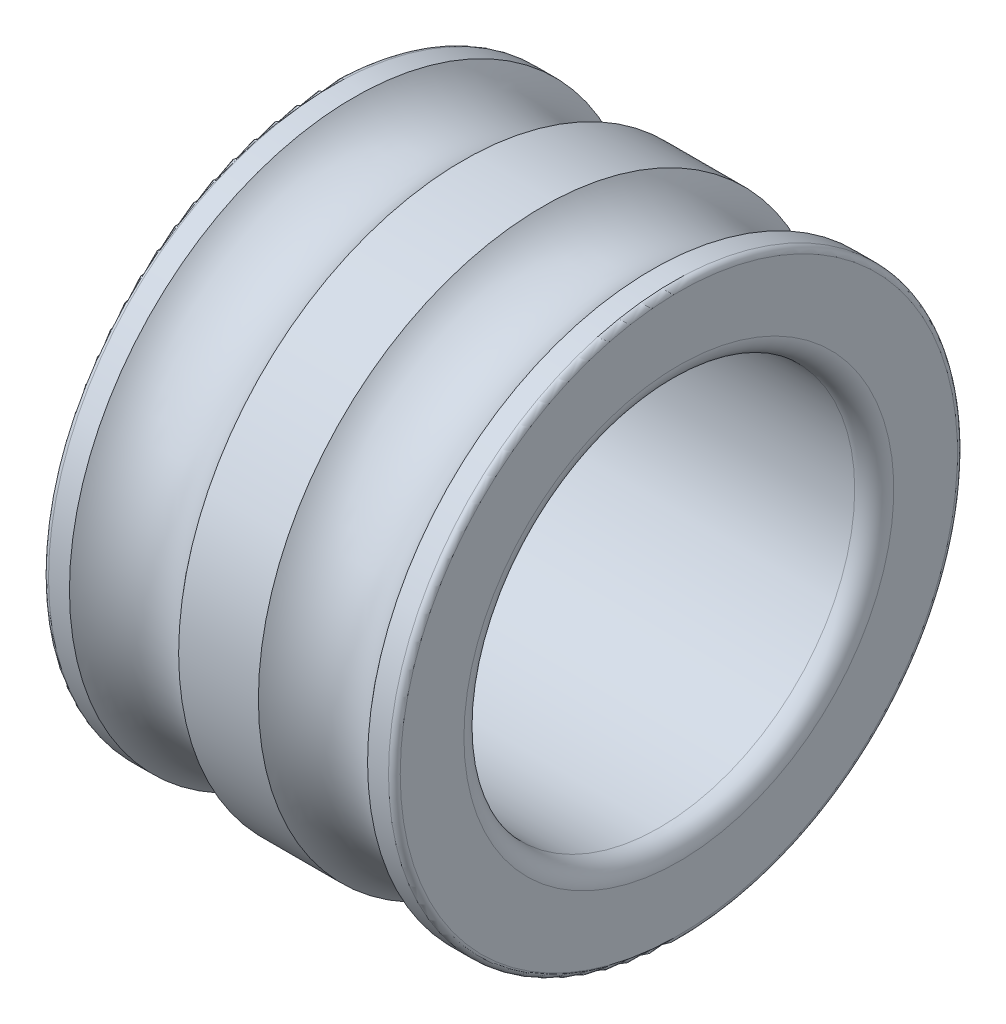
ISO-10303-21;
HEADER;
FILE_DESCRIPTION(('STEP AP214'),'2;1');
FILE_NAME('part.step','',(''),(''),'','','');
FILE_SCHEMA(('AUTOMOTIVE_DESIGN { 1 0 10303 214 1 1 1 1 }'));
ENDSEC;
DATA;
#1=APPLICATION_CONTEXT('core data for automotive mechanical design processes');
#2=APPLICATION_PROTOCOL_DEFINITION('international standard','automotive_design',2000,#1);
#3=PRODUCT_CONTEXT('',#1,'mechanical');
#4=PRODUCT('Part','Part','',(#3));
#5=PRODUCT_RELATED_PRODUCT_CATEGORY('part','',(#4));
#6=PRODUCT_DEFINITION_FORMATION('','',#4);
#7=PRODUCT_DEFINITION_CONTEXT('part definition',#1,'design');
#8=PRODUCT_DEFINITION('design','',#6,#7);
#9=PRODUCT_DEFINITION_SHAPE('','',#8);
#10=(LENGTH_UNIT() NAMED_UNIT(*) SI_UNIT(.MILLI.,.METRE.));
#11=(NAMED_UNIT(*) PLANE_ANGLE_UNIT() SI_UNIT($,.RADIAN.));
#12=(NAMED_UNIT(*) SI_UNIT($,.STERADIAN.) SOLID_ANGLE_UNIT());
#13=UNCERTAINTY_MEASURE_WITH_UNIT(LENGTH_MEASURE(1.E-05),#10,'distance_accuracy_value','');
#14=(GEOMETRIC_REPRESENTATION_CONTEXT(3) GLOBAL_UNCERTAINTY_ASSIGNED_CONTEXT((#13)) GLOBAL_UNIT_ASSIGNED_CONTEXT((#10,
#11,#12)) REPRESENTATION_CONTEXT('',''));
#15=CARTESIAN_POINT('',(0.,0.,0.));
#16=DIRECTION('',(0.,0.,1.));
#17=DIRECTION('',(1.,0.,0.));
#18=AXIS2_PLACEMENT_3D('',#15,#16,#17);
#19=CARTESIAN_POINT('',(0.,0.,0.));
#20=DIRECTION('',(-1.,0.,0.));
#21=DIRECTION('',(0.,0.,1.));
#22=AXIS2_PLACEMENT_3D('',#19,#20,#21);
#23=CYLINDRICAL_SURFACE('',#22,14.56);
#24=CARTESIAN_POINT('',(11.0406455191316,0.,0.));
#25=DIRECTION('',(-1.,0.,0.));
#26=DIRECTION('',(0.,0.,1.));
#27=AXIS2_PLACEMENT_3D('',#24,#25,#26);
#28=CIRCLE('',#27,14.56);
#29=CARTESIAN_POINT('',(11.0406455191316,0.,14.56));
#30=VERTEX_POINT('',#29);
#31=EDGE_CURVE('E10',#30,#30,#28,.T.);
#32=ORIENTED_EDGE('',*,*,#31,.T.);
#33=EDGE_LOOP('',(#32));
#34=FACE_BOUND('',#33,.T.);
#35=CARTESIAN_POINT('',(6.95935448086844,0.,0.));
#36=DIRECTION('',(-1.,0.,0.));
#37=DIRECTION('',(0.,0.,1.));
#38=AXIS2_PLACEMENT_3D('',#35,#36,#37);
#39=CIRCLE('',#38,14.56);
#40=CARTESIAN_POINT('',(6.95935448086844,0.,14.56));
#41=VERTEX_POINT('',#40);
#42=EDGE_CURVE('E55',#41,#41,#39,.T.);
#43=ORIENTED_EDGE('',*,*,#42,.F.);
#44=EDGE_LOOP('',(#43));
#45=FACE_BOUND('',#44,.T.);
#46=ADVANCED_FACE('F15',(#34,#45),#23,.T.);
#47=CARTESIAN_POINT('',(13.8346390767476,0.,0.));
#48=DIRECTION('',(-1.,0.,0.));
#49=DIRECTION('',(0.,0.,1.));
#50=AXIS2_PLACEMENT_3D('',#47,#48,#49);
#51=TOROIDAL_SURFACE('',#50,16.75,3.55);
#52=CARTESIAN_POINT('',(16.6286326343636,0.,0.));
#53=DIRECTION('',(-1.,0.,0.));
#54=DIRECTION('',(0.,0.,1.));
#55=AXIS2_PLACEMENT_3D('',#52,#53,#54);
#56=CIRCLE('',#55,14.56);
#57=CARTESIAN_POINT('',(16.6286326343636,0.,14.56));
#58=VERTEX_POINT('',#57);
#59=EDGE_CURVE('E21',#58,#58,#56,.T.);
#60=ORIENTED_EDGE('',*,*,#59,.T.);
#61=EDGE_LOOP('',(#60));
#62=FACE_BOUND('',#61,.T.);
#63=ORIENTED_EDGE('',*,*,#31,.F.);
#64=EDGE_LOOP('',(#63));
#65=FACE_BOUND('',#64,.T.);
#66=ADVANCED_FACE('F63',(#62,#65),#51,.F.);
#67=CARTESIAN_POINT('',(0.,0.,0.));
#68=DIRECTION('',(-1.,0.,0.));
#69=DIRECTION('',(0.,0.,1.));
#70=AXIS2_PLACEMENT_3D('',#67,#68,#69);
#71=CYLINDRICAL_SURFACE('',#70,14.56);
#72=CARTESIAN_POINT('',(17.7,0.,0.));
#73=DIRECTION('',(-1.,0.,0.));
#74=DIRECTION('',(0.,0.,1.));
#75=AXIS2_PLACEMENT_3D('',#72,#73,#74);
#76=CIRCLE('',#75,14.56);
#77=CARTESIAN_POINT('',(17.7,0.,14.56));
#78=VERTEX_POINT('',#77);
#79=EDGE_CURVE('E25',#78,#78,#76,.T.);
#80=ORIENTED_EDGE('',*,*,#79,.T.);
#81=EDGE_LOOP('',(#80));
#82=FACE_BOUND('',#81,.T.);
#83=ORIENTED_EDGE('',*,*,#59,.F.);
#84=EDGE_LOOP('',(#83));
#85=FACE_BOUND('',#84,.T.);
#86=ADVANCED_FACE('F69',(#82,#85),#71,.T.);
#87=CARTESIAN_POINT('',(17.7,0.,0.));
#88=DIRECTION('',(-1.,0.,0.));
#89=DIRECTION('',(0.,0.,1.));
#90=AXIS2_PLACEMENT_3D('',#87,#88,#89);
#91=TOROIDAL_SURFACE('',#90,14.26,0.3);
#92=ORIENTED_EDGE('',*,*,#79,.F.);
#93=EDGE_LOOP('',(#92));
#94=FACE_BOUND('',#93,.T.);
#95=CARTESIAN_POINT('',(18.,0.,0.));
#96=DIRECTION('',(-1.,0.,0.));
#97=DIRECTION('',(0.,0.,1.));
#98=AXIS2_PLACEMENT_3D('',#95,#96,#97);
#99=CIRCLE('',#98,14.26);
#100=CARTESIAN_POINT('',(18.,0.,14.26));
#101=VERTEX_POINT('',#100);
#102=EDGE_CURVE('E29',#101,#101,#99,.T.);
#103=ORIENTED_EDGE('',*,*,#102,.T.);
#104=EDGE_LOOP('',(#103));
#105=FACE_BOUND('',#104,.T.);
#106=ADVANCED_FACE('F74',(#94,#105),#91,.T.);
#107=CARTESIAN_POINT('',(18.,11.,0.));
#108=DIRECTION('',(-1.,0.,0.));
#109=DIRECTION('',(0.,0.,1.));
#110=AXIS2_PLACEMENT_3D('',#107,#108,#109);
#111=PLANE('',#110);
#112=ORIENTED_EDGE('',*,*,#102,.F.);
#113=EDGE_LOOP('',(#112));
#114=FACE_BOUND('',#113,.T.);
#115=CARTESIAN_POINT('',(18.,0.,0.));
#116=DIRECTION('',(-1.,0.,0.));
#117=DIRECTION('',(0.,0.,1.));
#118=AXIS2_PLACEMENT_3D('',#115,#116,#117);
#119=CIRCLE('',#118,11.);
#120=CARTESIAN_POINT('',(18.,0.,11.));
#121=VERTEX_POINT('',#120);
#122=EDGE_CURVE('E34',#121,#121,#119,.T.);
#123=ORIENTED_EDGE('',*,*,#122,.T.);
#124=EDGE_LOOP('',(#123));
#125=FACE_BOUND('',#124,.T.);
#126=ADVANCED_FACE('F81',(#114,#125),#111,.F.);
#127=CARTESIAN_POINT('',(17.,0.,0.));
#128=DIRECTION('',(-1.,0.,0.));
#129=DIRECTION('',(0.,0.,1.));
#130=AXIS2_PLACEMENT_3D('',#127,#128,#129);
#131=TOROIDAL_SURFACE('',#130,11.,1.);
#132=ORIENTED_EDGE('',*,*,#122,.F.);
#133=EDGE_LOOP('',(#132));
#134=FACE_BOUND('',#133,.T.);
#135=CARTESIAN_POINT('',(17.,0.,0.));
#136=DIRECTION('',(-1.,0.,0.));
#137=DIRECTION('',(0.,0.,1.));
#138=AXIS2_PLACEMENT_3D('',#135,#136,#137);
#139=CIRCLE('',#138,10.);
#140=CARTESIAN_POINT('',(17.,0.,10.));
#141=VERTEX_POINT('',#140);
#142=EDGE_CURVE('E37',#141,#141,#139,.T.);
#143=ORIENTED_EDGE('',*,*,#142,.T.);
#144=EDGE_LOOP('',(#143));
#145=FACE_BOUND('',#144,.T.);
#146=ADVANCED_FACE('F85',(#134,#145),#131,.T.);
#147=CARTESIAN_POINT('',(0.,0.,0.));
#148=DIRECTION('',(-1.,0.,0.));
#149=DIRECTION('',(0.,0.,1.));
#150=AXIS2_PLACEMENT_3D('',#147,#148,#149);
#151=CYLINDRICAL_SURFACE('',#150,10.);
#152=ORIENTED_EDGE('',*,*,#142,.F.);
#153=EDGE_LOOP('',(#152));
#154=FACE_BOUND('',#153,.T.);
#155=CARTESIAN_POINT('',(1.,0.,0.));
#156=DIRECTION('',(-1.,0.,0.));
#157=DIRECTION('',(0.,0.,1.));
#158=AXIS2_PLACEMENT_3D('',#155,#156,#157);
#159=CIRCLE('',#158,10.);
#160=CARTESIAN_POINT('',(1.,0.,10.));
#161=VERTEX_POINT('',#160);
#162=EDGE_CURVE('E40',#161,#161,#159,.T.);
#163=ORIENTED_EDGE('',*,*,#162,.T.);
#164=EDGE_LOOP('',(#163));
#165=FACE_BOUND('',#164,.T.);
#166=ADVANCED_FACE('F89',(#154,#165),#151,.F.);
#167=CARTESIAN_POINT('',(1.,0.,0.));
#168=DIRECTION('',(-1.,0.,0.));
#169=DIRECTION('',(0.,0.,1.));
#170=AXIS2_PLACEMENT_3D('',#167,#168,#169);
#171=TOROIDAL_SURFACE('',#170,11.,1.);
#172=ORIENTED_EDGE('',*,*,#162,.F.);
#173=EDGE_LOOP('',(#172));
#174=FACE_BOUND('',#173,.T.);
#175=CARTESIAN_POINT('',(0.,0.,0.));
#176=DIRECTION('',(-1.,0.,0.));
#177=DIRECTION('',(0.,0.,1.));
#178=AXIS2_PLACEMENT_3D('',#175,#176,#177);
#179=CIRCLE('',#178,11.);
#180=CARTESIAN_POINT('',(0.,0.,11.));
#181=VERTEX_POINT('',#180);
#182=EDGE_CURVE('E43',#181,#181,#179,.T.);
#183=ORIENTED_EDGE('',*,*,#182,.T.);
#184=EDGE_LOOP('',(#183));
#185=FACE_BOUND('',#184,.T.);
#186=ADVANCED_FACE('F93',(#174,#185),#171,.T.);
#187=CARTESIAN_POINT('',(0.,14.26,0.));
#188=DIRECTION('',(1.,0.,0.));
#189=DIRECTION('',(0.,0.,-1.));
#190=AXIS2_PLACEMENT_3D('',#187,#188,#189);
#191=PLANE('',#190);
#192=ORIENTED_EDGE('',*,*,#182,.F.);
#193=EDGE_LOOP('',(#192));
#194=FACE_BOUND('',#193,.T.);
#195=CARTESIAN_POINT('',(0.,0.,0.));
#196=DIRECTION('',(-1.,0.,0.));
#197=DIRECTION('',(0.,0.,1.));
#198=AXIS2_PLACEMENT_3D('',#195,#196,#197);
#199=CIRCLE('',#198,14.26);
#200=CARTESIAN_POINT('',(0.,0.,14.26));
#201=VERTEX_POINT('',#200);
#202=EDGE_CURVE('E46',#201,#201,#199,.T.);
#203=ORIENTED_EDGE('',*,*,#202,.T.);
#204=EDGE_LOOP('',(#203));
#205=FACE_BOUND('',#204,.T.);
#206=ADVANCED_FACE('F97',(#194,#205),#191,.F.);
#207=CARTESIAN_POINT('',(0.3,0.,0.));
#208=DIRECTION('',(-1.,0.,0.));
#209=DIRECTION('',(0.,0.,1.));
#210=AXIS2_PLACEMENT_3D('',#207,#208,#209);
#211=TOROIDAL_SURFACE('',#210,14.26,0.3);
#212=ORIENTED_EDGE('',*,*,#202,.F.);
#213=EDGE_LOOP('',(#212));
#214=FACE_BOUND('',#213,.T.);
#215=CARTESIAN_POINT('',(0.3,0.,0.));
#216=DIRECTION('',(-1.,0.,0.));
#217=DIRECTION('',(0.,0.,1.));
#218=AXIS2_PLACEMENT_3D('',#215,#216,#217);
#219=CIRCLE('',#218,14.56);
#220=CARTESIAN_POINT('',(0.3,0.,14.56));
#221=VERTEX_POINT('',#220);
#222=EDGE_CURVE('E49',#221,#221,#219,.T.);
#223=ORIENTED_EDGE('',*,*,#222,.T.);
#224=EDGE_LOOP('',(#223));
#225=FACE_BOUND('',#224,.T.);
#226=ADVANCED_FACE('F101',(#214,#225),#211,.T.);
#227=CARTESIAN_POINT('',(0.,0.,0.));
#228=DIRECTION('',(-1.,0.,0.));
#229=DIRECTION('',(0.,0.,1.));
#230=AXIS2_PLACEMENT_3D('',#227,#228,#229);
#231=CYLINDRICAL_SURFACE('',#230,14.56);
#232=CARTESIAN_POINT('',(1.37136736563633,0.,0.));
#233=DIRECTION('',(-1.,0.,0.));
#234=DIRECTION('',(0.,0.,1.));
#235=AXIS2_PLACEMENT_3D('',#232,#233,#234);
#236=CIRCLE('',#235,14.56);
#237=CARTESIAN_POINT('',(1.37136736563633,0.,14.56));
#238=VERTEX_POINT('',#237);
#239=EDGE_CURVE('E52',#238,#238,#236,.T.);
#240=ORIENTED_EDGE('',*,*,#239,.T.);
#241=EDGE_LOOP('',(#240));
#242=FACE_BOUND('',#241,.T.);
#243=ORIENTED_EDGE('',*,*,#222,.F.);
#244=EDGE_LOOP('',(#243));
#245=FACE_BOUND('',#244,.T.);
#246=ADVANCED_FACE('F105',(#242,#245),#231,.T.);
#247=CARTESIAN_POINT('',(4.16536092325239,0.,0.));
#248=DIRECTION('',(-1.,0.,0.));
#249=DIRECTION('',(0.,0.,1.));
#250=AXIS2_PLACEMENT_3D('',#247,#248,#249);
#251=TOROIDAL_SURFACE('',#250,16.75,3.55);
#252=ORIENTED_EDGE('',*,*,#42,.T.);
#253=EDGE_LOOP('',(#252));
#254=FACE_BOUND('',#253,.T.);
#255=ORIENTED_EDGE('',*,*,#239,.F.);
#256=EDGE_LOOP('',(#255));
#257=FACE_BOUND('',#256,.T.);
#258=ADVANCED_FACE('F59',(#254,#257),#251,.F.);
#259=CLOSED_SHELL('',(#46,#66,#86,#106,#126,#146,#166,#186,#206,#226,#246,#258));
#260=MANIFOLD_SOLID_BREP('B1',#259);
#261=ADVANCED_BREP_SHAPE_REPRESENTATION('',(#18,#260),#14);
#262=SHAPE_DEFINITION_REPRESENTATION(#9,#261);
ENDSEC;
END-ISO-10303-21;
